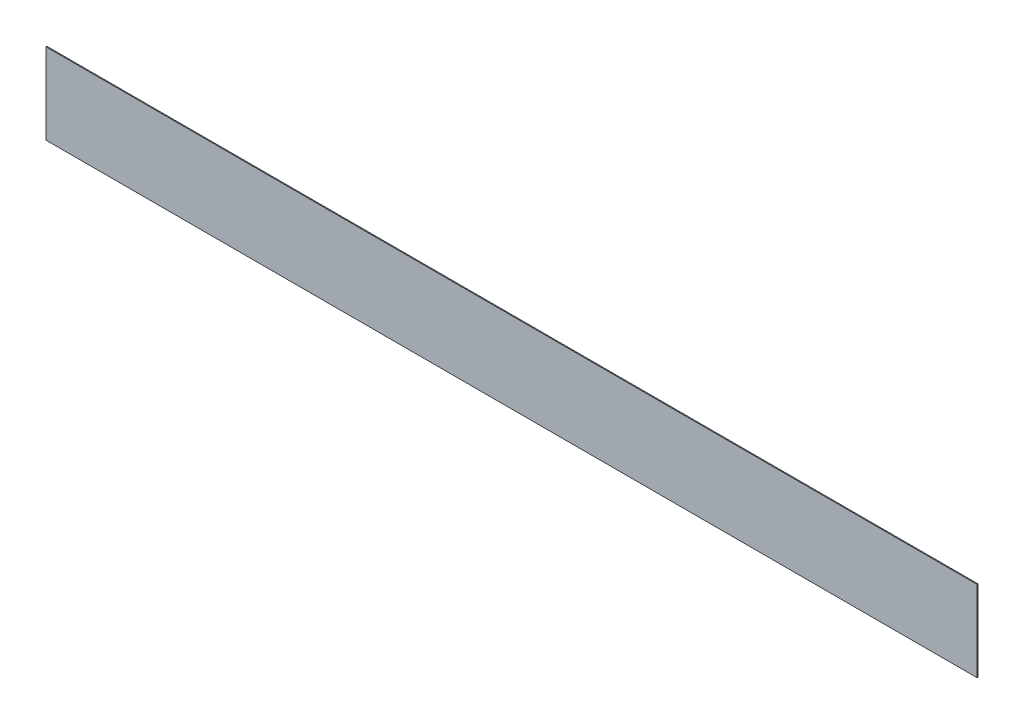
from build123d import *

# Parameters (mm, degrees)
SKETCH1_W           = 2047.24
SKETCH1_H           = 177.8
BOSS_EXTRUDE1_DEPTH = 2.032


with BuildPart() as part:
    # Sketch1 → Boss-Extrude1 (new body)
    with BuildSketch(Plane.XY):
        with Locations((1023.62, 88.9)):
            Rectangle(SKETCH1_W, SKETCH1_H)
    extrude(amount=BOSS_EXTRUDE1_DEPTH)


solid = part.part
